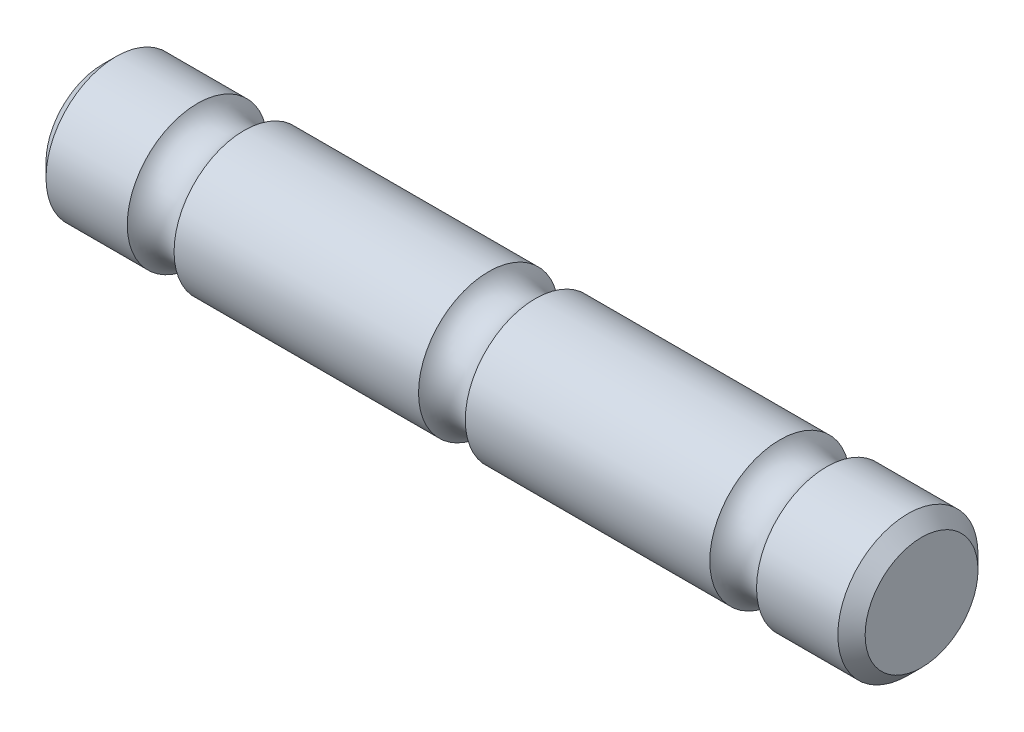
ISO-10303-21;
HEADER;
FILE_DESCRIPTION(('STEP AP214'),'2;1');
FILE_NAME('part.step','',(''),(''),'','','');
FILE_SCHEMA(('AUTOMOTIVE_DESIGN { 1 0 10303 214 1 1 1 1 }'));
ENDSEC;
DATA;
#1=APPLICATION_CONTEXT('core data for automotive mechanical design processes');
#2=APPLICATION_PROTOCOL_DEFINITION('international standard','automotive_design',2000,#1);
#3=PRODUCT_CONTEXT('',#1,'mechanical');
#4=PRODUCT('Part','Part','',(#3));
#5=PRODUCT_RELATED_PRODUCT_CATEGORY('part','',(#4));
#6=PRODUCT_DEFINITION_FORMATION('','',#4);
#7=PRODUCT_DEFINITION_CONTEXT('part definition',#1,'design');
#8=PRODUCT_DEFINITION('design','',#6,#7);
#9=PRODUCT_DEFINITION_SHAPE('','',#8);
#10=(LENGTH_UNIT() NAMED_UNIT(*) SI_UNIT(.MILLI.,.METRE.));
#11=(NAMED_UNIT(*) PLANE_ANGLE_UNIT() SI_UNIT($,.RADIAN.));
#12=(NAMED_UNIT(*) SI_UNIT($,.STERADIAN.) SOLID_ANGLE_UNIT());
#13=UNCERTAINTY_MEASURE_WITH_UNIT(LENGTH_MEASURE(1.E-05),#10,'distance_accuracy_value','');
#14=(GEOMETRIC_REPRESENTATION_CONTEXT(3) GLOBAL_UNCERTAINTY_ASSIGNED_CONTEXT((#13)) GLOBAL_UNIT_ASSIGNED_CONTEXT((#10,
#11,#12)) REPRESENTATION_CONTEXT('',''));
#15=CARTESIAN_POINT('',(0.,0.,0.));
#16=DIRECTION('',(0.,0.,1.));
#17=DIRECTION('',(1.,0.,0.));
#18=AXIS2_PLACEMENT_3D('',#15,#16,#17);
#19=CARTESIAN_POINT('',(22.86,1.5748,0.));
#20=DIRECTION('',(-1.,0.,0.));
#21=DIRECTION('',(0.,0.,1.));
#22=AXIS2_PLACEMENT_3D('',#19,#20,#21);
#23=PLANE('',#22);
#24=CARTESIAN_POINT('',(22.86,0.,0.));
#25=DIRECTION('',(1.,0.,0.));
#26=DIRECTION('',(0.,0.,-1.));
#27=AXIS2_PLACEMENT_3D('',#24,#25,#26);
#28=CIRCLE('',#27,1.5748);
#29=CARTESIAN_POINT('',(22.86,1.5748,0.));
#30=VERTEX_POINT('',#29);
#31=CARTESIAN_POINT('',(22.86,-1.5748,0.));
#32=VERTEX_POINT('',#31);
#33=EDGE_CURVE('E11',#30,#32,#28,.T.);
#34=ORIENTED_EDGE('',*,*,#33,.T.);
#35=CARTESIAN_POINT('',(22.86,0.,0.));
#36=DIRECTION('',(1.,0.,0.));
#37=DIRECTION('',(0.,0.,-1.));
#38=AXIS2_PLACEMENT_3D('',#35,#36,#37);
#39=CIRCLE('',#38,1.5748);
#40=EDGE_CURVE('E27',#32,#30,#39,.T.);
#41=ORIENTED_EDGE('',*,*,#40,.T.);
#42=EDGE_LOOP('',(#34,#41));
#43=FACE_BOUND('',#42,.T.);
#44=ADVANCED_FACE('F16',(#43),#23,.F.);
#45=CARTESIAN_POINT('',(22.6695,0.,0.));
#46=DIRECTION('',(-1.,0.,0.));
#47=DIRECTION('',(0.,1.,0.));
#48=AXIS2_PLACEMENT_3D('',#45,#46,#47);
#49=CONICAL_SURFACE('',#48,1.7653,0.785398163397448);
#50=CARTESIAN_POINT('',(22.479,0.,0.));
#51=DIRECTION('',(1.,0.,0.));
#52=DIRECTION('',(0.,0.,-1.));
#53=AXIS2_PLACEMENT_3D('',#50,#51,#52);
#54=CIRCLE('',#53,1.9558);
#55=CARTESIAN_POINT('',(22.479,1.9558,0.));
#56=VERTEX_POINT('',#55);
#57=CARTESIAN_POINT('',(22.479,-1.9558,0.));
#58=VERTEX_POINT('',#57);
#59=EDGE_CURVE('E181',#56,#58,#54,.T.);
#60=ORIENTED_EDGE('',*,*,#59,.T.);
#61=DIRECTION('',(0.707106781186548,0.707106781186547,0.));
#62=VECTOR('',#61,1.);
#63=CARTESIAN_POINT('',(22.6695,-1.7653,0.));
#64=LINE('',#63,#62);
#65=EDGE_CURVE('E177',#58,#32,#64,.T.);
#66=ORIENTED_EDGE('',*,*,#65,.T.);
#67=ORIENTED_EDGE('',*,*,#33,.F.);
#68=ORIENTED_EDGE('',*,*,#40,.F.);
#69=ORIENTED_EDGE('',*,*,#65,.F.);
#70=CARTESIAN_POINT('',(22.479,0.,0.));
#71=DIRECTION('',(1.,0.,0.));
#72=DIRECTION('',(0.,0.,-1.));
#73=AXIS2_PLACEMENT_3D('',#70,#71,#72);
#74=CIRCLE('',#73,1.9558);
#75=EDGE_CURVE('E182',#58,#56,#74,.T.);
#76=ORIENTED_EDGE('',*,*,#75,.T.);
#77=EDGE_LOOP('',(#60,#66,#67,#68,#69,#76));
#78=FACE_BOUND('',#77,.T.);
#79=ADVANCED_FACE('F284',(#78),#49,.T.);
#80=CARTESIAN_POINT('',(21.3447071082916,0.,0.));
#81=DIRECTION('',(1.,0.,0.));
#82=DIRECTION('',(0.,1.,0.));
#83=AXIS2_PLACEMENT_3D('',#80,#81,#82);
#84=CYLINDRICAL_SURFACE('',#83,1.9558);
#85=ORIENTED_EDGE('',*,*,#59,.F.);
#86=ORIENTED_EDGE('',*,*,#75,.F.);
#87=DIRECTION('',(-1.,0.,0.));
#88=VECTOR('',#87,1.);
#89=CARTESIAN_POINT('',(21.3447071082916,-1.9558,0.));
#90=LINE('',#89,#88);
#91=CARTESIAN_POINT('',(20.2104142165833,-1.9558,0.));
#92=VERTEX_POINT('',#91);
#93=EDGE_CURVE('E176',#58,#92,#90,.T.);
#94=ORIENTED_EDGE('',*,*,#93,.T.);
#95=CARTESIAN_POINT('',(20.2104142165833,0.,0.));
#96=DIRECTION('',(1.,0.,0.));
#97=DIRECTION('',(0.,0.,-1.));
#98=AXIS2_PLACEMENT_3D('',#95,#96,#97);
#99=CIRCLE('',#98,1.9558);
#100=CARTESIAN_POINT('',(20.2104142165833,1.9558,0.));
#101=VERTEX_POINT('',#100);
#102=EDGE_CURVE('E166',#92,#101,#99,.T.);
#103=ORIENTED_EDGE('',*,*,#102,.T.);
#104=CARTESIAN_POINT('',(20.2104142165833,0.,0.));
#105=DIRECTION('',(1.,0.,0.));
#106=DIRECTION('',(0.,0.,-1.));
#107=AXIS2_PLACEMENT_3D('',#104,#105,#106);
#108=CIRCLE('',#107,1.9558);
#109=CARTESIAN_POINT('',(20.2104142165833,0.,1.9558));
#110=VERTEX_POINT('',#109);
#111=EDGE_CURVE('E162',#101,#110,#108,.T.);
#112=ORIENTED_EDGE('',*,*,#111,.T.);
#113=CARTESIAN_POINT('',(20.2104142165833,0.,0.));
#114=DIRECTION('',(1.,0.,0.));
#115=DIRECTION('',(0.,0.,-1.));
#116=AXIS2_PLACEMENT_3D('',#113,#114,#115);
#117=CIRCLE('',#116,1.9558);
#118=EDGE_CURVE('E167',#110,#92,#117,.T.);
#119=ORIENTED_EDGE('',*,*,#118,.T.);
#120=ORIENTED_EDGE('',*,*,#93,.F.);
#121=EDGE_LOOP('',(#85,#86,#94,#103,#112,#119,#120));
#122=FACE_BOUND('',#121,.T.);
#123=ADVANCED_FACE('F291',(#122),#84,.T.);
#124=CARTESIAN_POINT('',(19.558,0.,0.));
#125=DIRECTION('',(-1.,0.,0.));
#126=DIRECTION('',(0.,0.,-1.));
#127=AXIS2_PLACEMENT_3D('',#124,#125,#126);
#128=TOROIDAL_SURFACE('',#127,2.3495,0.762);
#129=CARTESIAN_POINT('',(18.9055857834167,0.,0.));
#130=DIRECTION('',(1.,0.,0.));
#131=DIRECTION('',(0.,0.,-1.));
#132=AXIS2_PLACEMENT_3D('',#129,#130,#131);
#133=CIRCLE('',#132,1.9558);
#134=CARTESIAN_POINT('',(18.9055857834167,1.9558,0.));
#135=VERTEX_POINT('',#134);
#136=CARTESIAN_POINT('',(18.9055857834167,0.,1.9558));
#137=VERTEX_POINT('',#136);
#138=EDGE_CURVE('E209',#135,#137,#133,.T.);
#139=ORIENTED_EDGE('',*,*,#138,.T.);
#140=CARTESIAN_POINT('',(19.558,0.,2.3495));
#141=DIRECTION('',(0.,-1.,0.));
#142=DIRECTION('',(0.,0.,1.));
#143=AXIS2_PLACEMENT_3D('',#140,#141,#142);
#144=CIRCLE('',#143,0.762);
#145=EDGE_CURVE('E160',#137,#110,#144,.T.);
#146=ORIENTED_EDGE('',*,*,#145,.T.);
#147=ORIENTED_EDGE('',*,*,#111,.F.);
#148=ORIENTED_EDGE('',*,*,#102,.F.);
#149=ORIENTED_EDGE('',*,*,#118,.F.);
#150=ORIENTED_EDGE('',*,*,#145,.F.);
#151=CARTESIAN_POINT('',(18.9055857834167,0.,0.));
#152=DIRECTION('',(1.,0.,0.));
#153=DIRECTION('',(0.,0.,-1.));
#154=AXIS2_PLACEMENT_3D('',#151,#152,#153);
#155=CIRCLE('',#154,1.9558);
#156=CARTESIAN_POINT('',(18.9055857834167,-1.9558,0.));
#157=VERTEX_POINT('',#156);
#158=EDGE_CURVE('E172',#137,#157,#155,.T.);
#159=ORIENTED_EDGE('',*,*,#158,.T.);
#160=CARTESIAN_POINT('',(18.9055857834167,0.,0.));
#161=DIRECTION('',(1.,0.,0.));
#162=DIRECTION('',(0.,0.,-1.));
#163=AXIS2_PLACEMENT_3D('',#160,#161,#162);
#164=CIRCLE('',#163,1.9558);
#165=EDGE_CURVE('E168',#157,#135,#164,.T.);
#166=ORIENTED_EDGE('',*,*,#165,.T.);
#167=EDGE_LOOP('',(#139,#146,#147,#148,#149,#150,#159,#166));
#168=FACE_BOUND('',#167,.T.);
#169=ADVANCED_FACE('F280',(#168),#128,.F.);
#170=CARTESIAN_POINT('',(15.494,0.,0.));
#171=DIRECTION('',(1.,0.,0.));
#172=DIRECTION('',(0.,1.,0.));
#173=AXIS2_PLACEMENT_3D('',#170,#171,#172);
#174=CYLINDRICAL_SURFACE('',#173,1.9558);
#175=ORIENTED_EDGE('',*,*,#138,.F.);
#176=ORIENTED_EDGE('',*,*,#165,.F.);
#177=DIRECTION('',(-1.,0.,0.));
#178=VECTOR('',#177,1.);
#179=CARTESIAN_POINT('',(15.494,-1.9558,0.));
#180=LINE('',#179,#178);
#181=CARTESIAN_POINT('',(12.0824142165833,-1.9558,0.));
#182=VERTEX_POINT('',#181);
#183=EDGE_CURVE('E173',#157,#182,#180,.T.);
#184=ORIENTED_EDGE('',*,*,#183,.T.);
#185=CARTESIAN_POINT('',(12.0824142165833,0.,0.));
#186=DIRECTION('',(1.,0.,0.));
#187=DIRECTION('',(0.,0.,-1.));
#188=AXIS2_PLACEMENT_3D('',#185,#186,#187);
#189=CIRCLE('',#188,1.9558);
#190=CARTESIAN_POINT('',(12.0824142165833,1.9558,0.));
#191=VERTEX_POINT('',#190);
#192=EDGE_CURVE('E261',#182,#191,#189,.T.);
#193=ORIENTED_EDGE('',*,*,#192,.T.);
#194=CARTESIAN_POINT('',(12.0824142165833,0.,0.));
#195=DIRECTION('',(1.,0.,0.));
#196=DIRECTION('',(0.,0.,-1.));
#197=AXIS2_PLACEMENT_3D('',#194,#195,#196);
#198=CIRCLE('',#197,1.9558);
#199=CARTESIAN_POINT('',(12.0824142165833,0.,1.9558));
#200=VERTEX_POINT('',#199);
#201=EDGE_CURVE('E257',#191,#200,#198,.T.);
#202=ORIENTED_EDGE('',*,*,#201,.T.);
#203=CARTESIAN_POINT('',(12.0824142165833,0.,0.));
#204=DIRECTION('',(1.,0.,0.));
#205=DIRECTION('',(0.,0.,-1.));
#206=AXIS2_PLACEMENT_3D('',#203,#204,#205);
#207=CIRCLE('',#206,1.9558);
#208=EDGE_CURVE('E253',#200,#182,#207,.T.);
#209=ORIENTED_EDGE('',*,*,#208,.T.);
#210=ORIENTED_EDGE('',*,*,#183,.F.);
#211=ORIENTED_EDGE('',*,*,#158,.F.);
#212=EDGE_LOOP('',(#175,#176,#184,#193,#202,#209,#210,#211));
#213=FACE_BOUND('',#212,.T.);
#214=ADVANCED_FACE('F272',(#213),#174,.T.);
#215=CARTESIAN_POINT('',(0.,1.5748,0.));
#216=DIRECTION('',(-1.,0.,0.));
#217=DIRECTION('',(0.,0.,1.));
#218=AXIS2_PLACEMENT_3D('',#215,#216,#217);
#219=PLANE('',#218);
#220=CARTESIAN_POINT('',(0.,0.,0.));
#221=DIRECTION('',(1.,0.,0.));
#222=DIRECTION('',(0.,0.,-1.));
#223=AXIS2_PLACEMENT_3D('',#220,#221,#222);
#224=CIRCLE('',#223,1.5748);
#225=CARTESIAN_POINT('',(0.,1.5748,0.));
#226=VERTEX_POINT('',#225);
#227=CARTESIAN_POINT('',(0.,-1.5748,0.));
#228=VERTEX_POINT('',#227);
#229=EDGE_CURVE('E157',#226,#228,#224,.T.);
#230=ORIENTED_EDGE('',*,*,#229,.F.);
#231=CARTESIAN_POINT('',(0.,0.,0.));
#232=DIRECTION('',(1.,0.,0.));
#233=DIRECTION('',(0.,0.,-1.));
#234=AXIS2_PLACEMENT_3D('',#231,#232,#233);
#235=CIRCLE('',#234,1.5748);
#236=EDGE_CURVE('E212',#228,#226,#235,.T.);
#237=ORIENTED_EDGE('',*,*,#236,.F.);
#238=EDGE_LOOP('',(#230,#237));
#239=FACE_BOUND('',#238,.T.);
#240=ADVANCED_FACE('F18',(#239),#219,.T.);
#241=CARTESIAN_POINT('',(0.1905,0.,0.));
#242=DIRECTION('',(1.,0.,0.));
#243=DIRECTION('',(0.,1.,0.));
#244=AXIS2_PLACEMENT_3D('',#241,#242,#243);
#245=CONICAL_SURFACE('',#244,1.7653,0.785398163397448);
#246=CARTESIAN_POINT('',(0.381,0.,0.));
#247=DIRECTION('',(1.,0.,0.));
#248=DIRECTION('',(0.,0.,-1.));
#249=AXIS2_PLACEMENT_3D('',#246,#247,#248);
#250=CIRCLE('',#249,1.9558);
#251=CARTESIAN_POINT('',(0.381,1.9558,0.));
#252=VERTEX_POINT('',#251);
#253=CARTESIAN_POINT('',(0.381,-1.9558,0.));
#254=VERTEX_POINT('',#253);
#255=EDGE_CURVE('E138',#252,#254,#250,.T.);
#256=ORIENTED_EDGE('',*,*,#255,.F.);
#257=CARTESIAN_POINT('',(0.381,0.,0.));
#258=DIRECTION('',(1.,0.,0.));
#259=DIRECTION('',(0.,0.,-1.));
#260=AXIS2_PLACEMENT_3D('',#257,#258,#259);
#261=CIRCLE('',#260,1.9558);
#262=EDGE_CURVE('E142',#254,#252,#261,.T.);
#263=ORIENTED_EDGE('',*,*,#262,.F.);
#264=DIRECTION('',(-0.707106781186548,0.707106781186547,0.));
#265=VECTOR('',#264,1.);
#266=CARTESIAN_POINT('',(0.1905,-1.7653,0.));
#267=LINE('',#266,#265);
#268=EDGE_CURVE('E143',#254,#228,#267,.T.);
#269=ORIENTED_EDGE('',*,*,#268,.T.);
#270=ORIENTED_EDGE('',*,*,#236,.T.);
#271=ORIENTED_EDGE('',*,*,#229,.T.);
#272=ORIENTED_EDGE('',*,*,#268,.F.);
#273=EDGE_LOOP('',(#256,#263,#269,#270,#271,#272));
#274=FACE_BOUND('',#273,.T.);
#275=ADVANCED_FACE('F140',(#274),#245,.T.);
#276=CARTESIAN_POINT('',(1.51529289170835,0.,0.));
#277=DIRECTION('',(1.,0.,0.));
#278=DIRECTION('',(0.,1.,0.));
#279=AXIS2_PLACEMENT_3D('',#276,#277,#278);
#280=CYLINDRICAL_SURFACE('',#279,1.9558);
#281=CARTESIAN_POINT('',(2.64958578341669,0.,0.));
#282=DIRECTION('',(1.,0.,0.));
#283=DIRECTION('',(0.,0.,-1.));
#284=AXIS2_PLACEMENT_3D('',#281,#282,#283);
#285=CIRCLE('',#284,1.9558);
#286=CARTESIAN_POINT('',(2.64958578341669,1.9558,0.));
#287=VERTEX_POINT('',#286);
#288=CARTESIAN_POINT('',(2.64958578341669,0.,1.9558));
#289=VERTEX_POINT('',#288);
#290=EDGE_CURVE('E93',#287,#289,#285,.T.);
#291=ORIENTED_EDGE('',*,*,#290,.F.);
#292=CARTESIAN_POINT('',(2.64958578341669,0.,0.));
#293=DIRECTION('',(1.,0.,0.));
#294=DIRECTION('',(0.,0.,-1.));
#295=AXIS2_PLACEMENT_3D('',#292,#293,#294);
#296=CIRCLE('',#295,1.9558);
#297=CARTESIAN_POINT('',(2.64958578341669,-1.9558,0.));
#298=VERTEX_POINT('',#297);
#299=EDGE_CURVE('E187',#298,#287,#296,.T.);
#300=ORIENTED_EDGE('',*,*,#299,.F.);
#301=DIRECTION('',(-1.,0.,0.));
#302=VECTOR('',#301,1.);
#303=CARTESIAN_POINT('',(1.51529289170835,-1.9558,0.));
#304=LINE('',#303,#302);
#305=EDGE_CURVE('E20',#298,#254,#304,.T.);
#306=ORIENTED_EDGE('',*,*,#305,.T.);
#307=ORIENTED_EDGE('',*,*,#262,.T.);
#308=ORIENTED_EDGE('',*,*,#255,.T.);
#309=ORIENTED_EDGE('',*,*,#305,.F.);
#310=CARTESIAN_POINT('',(2.64958578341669,0.,0.));
#311=DIRECTION('',(1.,0.,0.));
#312=DIRECTION('',(0.,0.,-1.));
#313=AXIS2_PLACEMENT_3D('',#310,#311,#312);
#314=CIRCLE('',#313,1.9558);
#315=EDGE_CURVE('E183',#289,#298,#314,.T.);
#316=ORIENTED_EDGE('',*,*,#315,.F.);
#317=EDGE_LOOP('',(#291,#300,#306,#307,#308,#309,#316));
#318=FACE_BOUND('',#317,.T.);
#319=ADVANCED_FACE('F150',(#318),#280,.T.);
#320=CARTESIAN_POINT('',(3.302,0.,0.));
#321=DIRECTION('',(1.,0.,0.));
#322=DIRECTION('',(0.,0.,-1.));
#323=AXIS2_PLACEMENT_3D('',#320,#321,#322);
#324=TOROIDAL_SURFACE('',#323,2.3495,0.762);
#325=CARTESIAN_POINT('',(3.95441421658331,0.,0.));
#326=DIRECTION('',(1.,0.,0.));
#327=DIRECTION('',(0.,0.,-1.));
#328=AXIS2_PLACEMENT_3D('',#325,#326,#327);
#329=CIRCLE('',#328,1.9558);
#330=CARTESIAN_POINT('',(3.95441421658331,1.9558,0.));
#331=VERTEX_POINT('',#330);
#332=CARTESIAN_POINT('',(3.95441421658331,0.,1.9558));
#333=VERTEX_POINT('',#332);
#334=EDGE_CURVE('E107',#331,#333,#329,.T.);
#335=ORIENTED_EDGE('',*,*,#334,.F.);
#336=CARTESIAN_POINT('',(3.95441421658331,0.,0.));
#337=DIRECTION('',(1.,0.,0.));
#338=DIRECTION('',(0.,0.,-1.));
#339=AXIS2_PLACEMENT_3D('',#336,#337,#338);
#340=CIRCLE('',#339,1.9558);
#341=CARTESIAN_POINT('',(3.95441421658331,-1.9558,0.));
#342=VERTEX_POINT('',#341);
#343=EDGE_CURVE('E195',#342,#331,#340,.T.);
#344=ORIENTED_EDGE('',*,*,#343,.F.);
#345=CARTESIAN_POINT('',(3.95441421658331,0.,0.));
#346=DIRECTION('',(1.,0.,0.));
#347=DIRECTION('',(0.,0.,-1.));
#348=AXIS2_PLACEMENT_3D('',#345,#346,#347);
#349=CIRCLE('',#348,1.9558);
#350=EDGE_CURVE('E224',#333,#342,#349,.T.);
#351=ORIENTED_EDGE('',*,*,#350,.F.);
#352=CARTESIAN_POINT('',(3.302,0.,2.3495));
#353=DIRECTION('',(0.,1.,0.));
#354=DIRECTION('',(0.,0.,1.));
#355=AXIS2_PLACEMENT_3D('',#352,#353,#354);
#356=CIRCLE('',#355,0.762);
#357=EDGE_CURVE('E148',#333,#289,#356,.T.);
#358=ORIENTED_EDGE('',*,*,#357,.T.);
#359=ORIENTED_EDGE('',*,*,#315,.T.);
#360=ORIENTED_EDGE('',*,*,#299,.T.);
#361=ORIENTED_EDGE('',*,*,#290,.T.);
#362=ORIENTED_EDGE('',*,*,#357,.F.);
#363=EDGE_LOOP('',(#335,#344,#351,#358,#359,#360,#361,#362));
#364=FACE_BOUND('',#363,.T.);
#365=ADVANCED_FACE('F294',(#364),#324,.F.);
#366=CARTESIAN_POINT('',(7.366,0.,0.));
#367=DIRECTION('',(1.,0.,0.));
#368=DIRECTION('',(0.,1.,0.));
#369=AXIS2_PLACEMENT_3D('',#366,#367,#368);
#370=CYLINDRICAL_SURFACE('',#369,1.9558);
#371=CARTESIAN_POINT('',(10.7775857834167,0.,0.));
#372=DIRECTION('',(1.,0.,0.));
#373=DIRECTION('',(0.,0.,-1.));
#374=AXIS2_PLACEMENT_3D('',#371,#372,#373);
#375=CIRCLE('',#374,1.9558);
#376=CARTESIAN_POINT('',(10.7775857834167,1.9558,0.));
#377=VERTEX_POINT('',#376);
#378=CARTESIAN_POINT('',(10.7775857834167,0.,1.9558));
#379=VERTEX_POINT('',#378);
#380=EDGE_CURVE('E223',#377,#379,#375,.T.);
#381=ORIENTED_EDGE('',*,*,#380,.F.);
#382=CARTESIAN_POINT('',(10.7775857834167,0.,0.));
#383=DIRECTION('',(1.,0.,0.));
#384=DIRECTION('',(0.,0.,-1.));
#385=AXIS2_PLACEMENT_3D('',#382,#383,#384);
#386=CIRCLE('',#385,1.9558);
#387=CARTESIAN_POINT('',(10.7775857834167,-1.9558,0.));
#388=VERTEX_POINT('',#387);
#389=EDGE_CURVE('E218',#388,#377,#386,.T.);
#390=ORIENTED_EDGE('',*,*,#389,.F.);
#391=DIRECTION('',(-1.,0.,0.));
#392=VECTOR('',#391,1.);
#393=CARTESIAN_POINT('',(7.366,-1.9558,0.));
#394=LINE('',#393,#392);
#395=EDGE_CURVE('E191',#388,#342,#394,.T.);
#396=ORIENTED_EDGE('',*,*,#395,.T.);
#397=ORIENTED_EDGE('',*,*,#343,.T.);
#398=ORIENTED_EDGE('',*,*,#334,.T.);
#399=ORIENTED_EDGE('',*,*,#350,.T.);
#400=ORIENTED_EDGE('',*,*,#395,.F.);
#401=CARTESIAN_POINT('',(10.7775857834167,0.,0.));
#402=DIRECTION('',(1.,0.,0.));
#403=DIRECTION('',(0.,0.,-1.));
#404=AXIS2_PLACEMENT_3D('',#401,#402,#403);
#405=CIRCLE('',#404,1.9558);
#406=EDGE_CURVE('E222',#379,#388,#405,.T.);
#407=ORIENTED_EDGE('',*,*,#406,.F.);
#408=EDGE_LOOP('',(#381,#390,#396,#397,#398,#399,#400,#407));
#409=FACE_BOUND('',#408,.T.);
#410=ADVANCED_FACE('F296',(#409),#370,.T.);
#411=CARTESIAN_POINT('',(11.43,0.,0.));
#412=DIRECTION('',(1.,0.,0.));
#413=DIRECTION('',(0.,0.,-1.));
#414=AXIS2_PLACEMENT_3D('',#411,#412,#413);
#415=TOROIDAL_SURFACE('',#414,2.3495,0.762);
#416=ORIENTED_EDGE('',*,*,#201,.F.);
#417=ORIENTED_EDGE('',*,*,#192,.F.);
#418=ORIENTED_EDGE('',*,*,#208,.F.);
#419=CARTESIAN_POINT('',(11.43,0.,2.3495));
#420=DIRECTION('',(0.,1.,0.));
#421=DIRECTION('',(0.,0.,1.));
#422=AXIS2_PLACEMENT_3D('',#419,#420,#421);
#423=CIRCLE('',#422,0.762);
#424=EDGE_CURVE('E227',#200,#379,#423,.T.);
#425=ORIENTED_EDGE('',*,*,#424,.T.);
#426=ORIENTED_EDGE('',*,*,#406,.T.);
#427=ORIENTED_EDGE('',*,*,#389,.T.);
#428=ORIENTED_EDGE('',*,*,#380,.T.);
#429=ORIENTED_EDGE('',*,*,#424,.F.);
#430=EDGE_LOOP('',(#416,#417,#418,#425,#426,#427,#428,#429));
#431=FACE_BOUND('',#430,.T.);
#432=ADVANCED_FACE('F298',(#431),#415,.F.);
#433=CLOSED_SHELL('',(#44,#79,#123,#169,#214,#240,#275,#319,#365,#410,#432));
#434=MANIFOLD_SOLID_BREP('B1',#433);
#435=ADVANCED_BREP_SHAPE_REPRESENTATION('',(#18,#434),#14);
#436=SHAPE_DEFINITION_REPRESENTATION(#9,#435);
ENDSEC;
END-ISO-10303-21;
